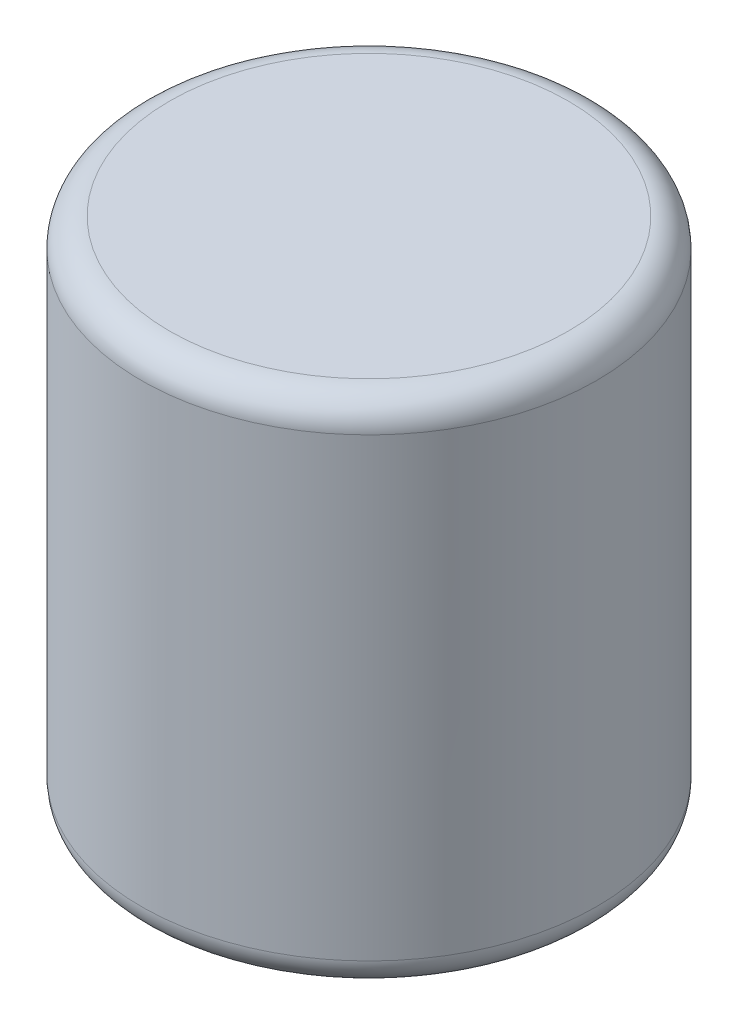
from build123d import *

# Parameters (mm, degrees)
FILLET1_R = 1


with BuildPart() as part:
    # Sketch1 → Revolve1 (revolve)
    with BuildSketch(Plane.XY):
        Polygon((6.2, 0), (8, 0), (8, 18), (0, 18), (0, 16.5), (5.5, 16.5), (5.5, 15.25), (6.2, 15.25), (6.2, 14.5), (6.5, 14.5), (6.5, 0.75), (6.2, 0.75), align=None)
    revolve(axis=Axis((0, 0, 0), (0, 1, 0)))

    # Fillet1
    fillet1_edges = [part.edges().sort_by_distance(p)[0] for p in [
        (-8, 18, 0),
        (-8, 0, 0),
    ]]
    fillet(fillet1_edges, radius=FILLET1_R)


solid = part.part
